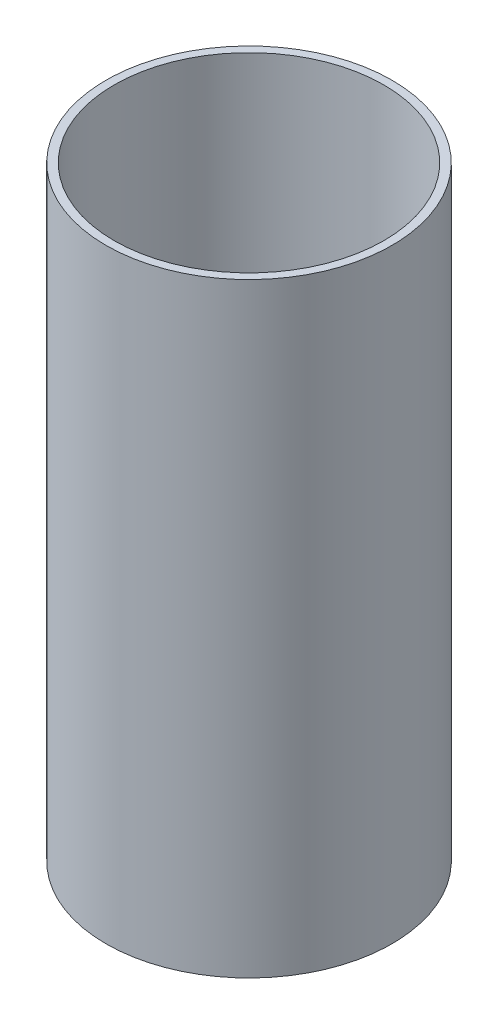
ISO-10303-21;
HEADER;
FILE_DESCRIPTION(('STEP AP214'),'2;1');
FILE_NAME('part.step','',(''),(''),'','','');
FILE_SCHEMA(('AUTOMOTIVE_DESIGN { 1 0 10303 214 1 1 1 1 }'));
ENDSEC;
DATA;
#1=APPLICATION_CONTEXT('core data for automotive mechanical design processes');
#2=APPLICATION_PROTOCOL_DEFINITION('international standard','automotive_design',2000,#1);
#3=PRODUCT_CONTEXT('',#1,'mechanical');
#4=PRODUCT('Part','Part','',(#3));
#5=PRODUCT_RELATED_PRODUCT_CATEGORY('part','',(#4));
#6=PRODUCT_DEFINITION_FORMATION('','',#4);
#7=PRODUCT_DEFINITION_CONTEXT('part definition',#1,'design');
#8=PRODUCT_DEFINITION('design','',#6,#7);
#9=PRODUCT_DEFINITION_SHAPE('','',#8);
#10=(LENGTH_UNIT() NAMED_UNIT(*) SI_UNIT(.MILLI.,.METRE.));
#11=(NAMED_UNIT(*) PLANE_ANGLE_UNIT() SI_UNIT($,.RADIAN.));
#12=(NAMED_UNIT(*) SI_UNIT($,.STERADIAN.) SOLID_ANGLE_UNIT());
#13=UNCERTAINTY_MEASURE_WITH_UNIT(LENGTH_MEASURE(1.E-05),#10,'distance_accuracy_value','');
#14=(GEOMETRIC_REPRESENTATION_CONTEXT(3) GLOBAL_UNCERTAINTY_ASSIGNED_CONTEXT((#13)) GLOBAL_UNIT_ASSIGNED_CONTEXT((#10,
#11,#12)) REPRESENTATION_CONTEXT('',''));
#15=CARTESIAN_POINT('',(0.,0.,0.));
#16=DIRECTION('',(0.,0.,1.));
#17=DIRECTION('',(1.,0.,0.));
#18=AXIS2_PLACEMENT_3D('',#15,#16,#17);
#19=CARTESIAN_POINT('',(0.,114.808,0.));
#20=DIRECTION('',(0.,1.,0.));
#21=DIRECTION('',(0.,0.,1.));
#22=AXIS2_PLACEMENT_3D('',#19,#20,#21);
#23=PLANE('',#22);
#24=CARTESIAN_POINT('',(0.,114.808,0.));
#25=DIRECTION('',(0.,1.,0.));
#26=DIRECTION('',(0.,0.,1.));
#27=AXIS2_PLACEMENT_3D('',#24,#25,#26);
#28=CIRCLE('',#27,27.1526);
#29=CARTESIAN_POINT('',(0.,114.808,27.1526));
#30=VERTEX_POINT('',#29);
#31=EDGE_CURVE('E11',#30,#30,#28,.T.);
#32=ORIENTED_EDGE('',*,*,#31,.T.);
#33=EDGE_LOOP('',(#32));
#34=FACE_BOUND('',#33,.T.);
#35=CARTESIAN_POINT('',(0.,114.808,0.));
#36=DIRECTION('',(0.,1.,0.));
#37=DIRECTION('',(1.,0.,0.));
#38=AXIS2_PLACEMENT_3D('',#35,#36,#37);
#39=CIRCLE('',#38,25.6032);
#40=CARTESIAN_POINT('',(25.6032,114.808,0.));
#41=VERTEX_POINT('',#40);
#42=EDGE_CURVE('E48',#41,#41,#39,.T.);
#43=ORIENTED_EDGE('',*,*,#42,.F.);
#44=EDGE_LOOP('',(#43));
#45=FACE_BOUND('',#44,.T.);
#46=ADVANCED_FACE('F37',(#34,#45),#23,.T.);
#47=CARTESIAN_POINT('',(0.,0.,0.));
#48=DIRECTION('',(0.,1.,0.));
#49=DIRECTION('',(0.,0.,1.));
#50=AXIS2_PLACEMENT_3D('',#47,#48,#49);
#51=PLANE('',#50);
#52=CARTESIAN_POINT('',(0.,0.,0.));
#53=DIRECTION('',(0.,1.,0.));
#54=DIRECTION('',(0.,0.,1.));
#55=AXIS2_PLACEMENT_3D('',#52,#53,#54);
#56=CIRCLE('',#55,27.1526);
#57=CARTESIAN_POINT('',(0.,0.,27.1526));
#58=VERTEX_POINT('',#57);
#59=EDGE_CURVE('E41',#58,#58,#56,.T.);
#60=ORIENTED_EDGE('',*,*,#59,.F.);
#61=EDGE_LOOP('',(#60));
#62=FACE_BOUND('',#61,.T.);
#63=CARTESIAN_POINT('',(0.,0.,0.));
#64=DIRECTION('',(0.,1.,0.));
#65=DIRECTION('',(1.,0.,0.));
#66=AXIS2_PLACEMENT_3D('',#63,#64,#65);
#67=CIRCLE('',#66,25.6032);
#68=CARTESIAN_POINT('',(25.6032,0.,0.));
#69=VERTEX_POINT('',#68);
#70=EDGE_CURVE('E50',#69,#69,#67,.T.);
#71=ORIENTED_EDGE('',*,*,#70,.T.);
#72=EDGE_LOOP('',(#71));
#73=FACE_BOUND('',#72,.T.);
#74=ADVANCED_FACE('F60',(#62,#73),#51,.F.);
#75=CARTESIAN_POINT('',(0.,114.808,0.));
#76=DIRECTION('',(0.,-1.,0.));
#77=DIRECTION('',(0.,0.,-1.));
#78=AXIS2_PLACEMENT_3D('',#75,#76,#77);
#79=CYLINDRICAL_SURFACE('',#78,27.1526);
#80=ORIENTED_EDGE('',*,*,#31,.F.);
#81=EDGE_LOOP('',(#80));
#82=FACE_BOUND('',#81,.T.);
#83=ORIENTED_EDGE('',*,*,#59,.T.);
#84=EDGE_LOOP('',(#83));
#85=FACE_BOUND('',#84,.T.);
#86=ADVANCED_FACE('F39',(#82,#85),#79,.T.);
#87=CARTESIAN_POINT('',(0.,114.808,0.));
#88=DIRECTION('',(0.,-1.,0.));
#89=DIRECTION('',(0.,0.,-1.));
#90=AXIS2_PLACEMENT_3D('',#87,#88,#89);
#91=CYLINDRICAL_SURFACE('',#90,25.6032);
#92=ORIENTED_EDGE('',*,*,#42,.T.);
#93=EDGE_LOOP('',(#92));
#94=FACE_BOUND('',#93,.T.);
#95=ORIENTED_EDGE('',*,*,#70,.F.);
#96=EDGE_LOOP('',(#95));
#97=FACE_BOUND('',#96,.T.);
#98=ADVANCED_FACE('F56',(#94,#97),#91,.F.);
#99=CLOSED_SHELL('',(#46,#74,#86,#98));
#100=MANIFOLD_SOLID_BREP('B2',#99);
#101=ADVANCED_BREP_SHAPE_REPRESENTATION('',(#18,#100),#14);
#102=SHAPE_DEFINITION_REPRESENTATION(#9,#101);
ENDSEC;
END-ISO-10303-21;
